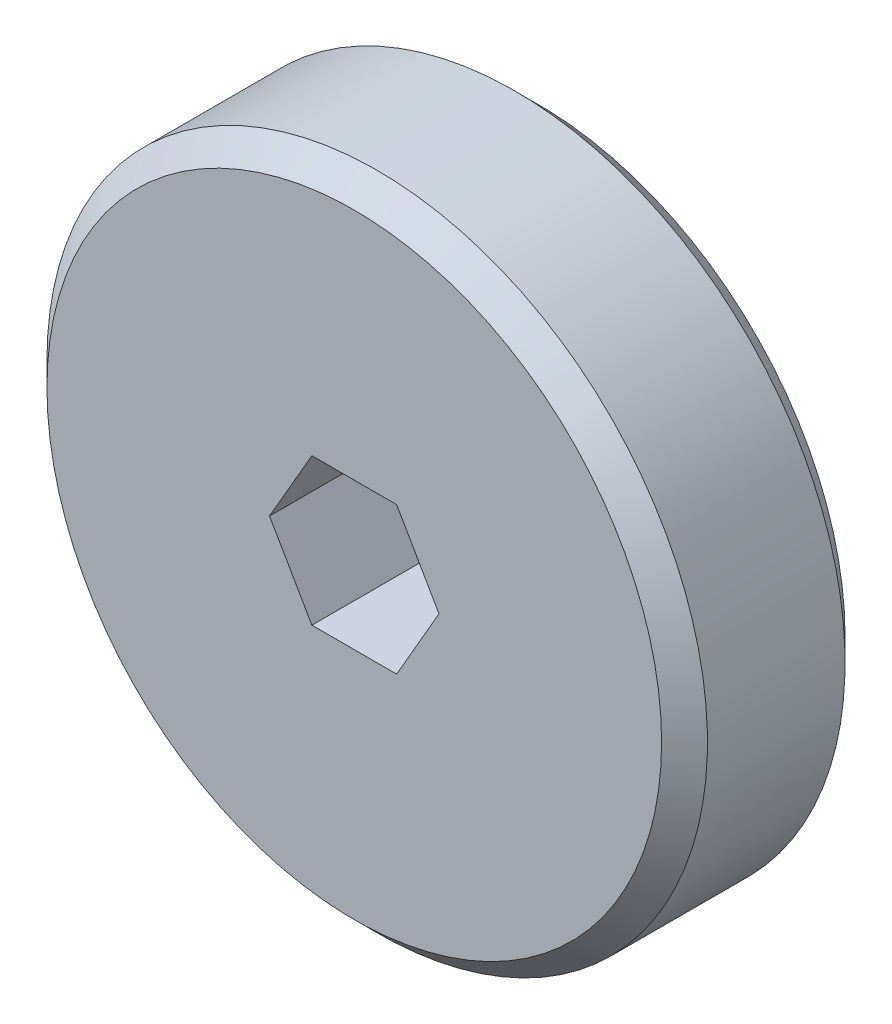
from build123d import *

# Parameters (mm, degrees)
CUT_EXTRUDE1_DEPTH = 22.708736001


with BuildPart() as part:
    # Logo3_bib1 → Revolve1 (revolve)
    with BuildSketch(Plane(origin=(0, 0, 0), x_dir=(-1, 0, 0), z_dir=(0, -1, 0))):
        Polygon((0, -7.9375), (0, 0), (13.29563, 0), (14.2875, -0.99187), (14.2875, -6.94563), (13.29563, -7.9375), align=None)
    revolve(axis=Axis((0, 0, -10.585154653), (0, 0, 1)))

    # Logo3_bib2 → Cut-Extrude1 (cut, through all)
    with BuildSketch(Plane(origin=(0, 0, 0), x_dir=(1, 0, 0), z_dir=(0, 0, -1))):
        Polygon((3.666174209, 0), (1.833087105, 3.175), (-1.833087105, 3.175), (-3.666174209, 0), (-1.833087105, -3.175), (1.833087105, -3.175), align=None)
    extrude(amount=-CUT_EXTRUDE1_DEPTH, mode=Mode.SUBTRACT)


solid = part.part
